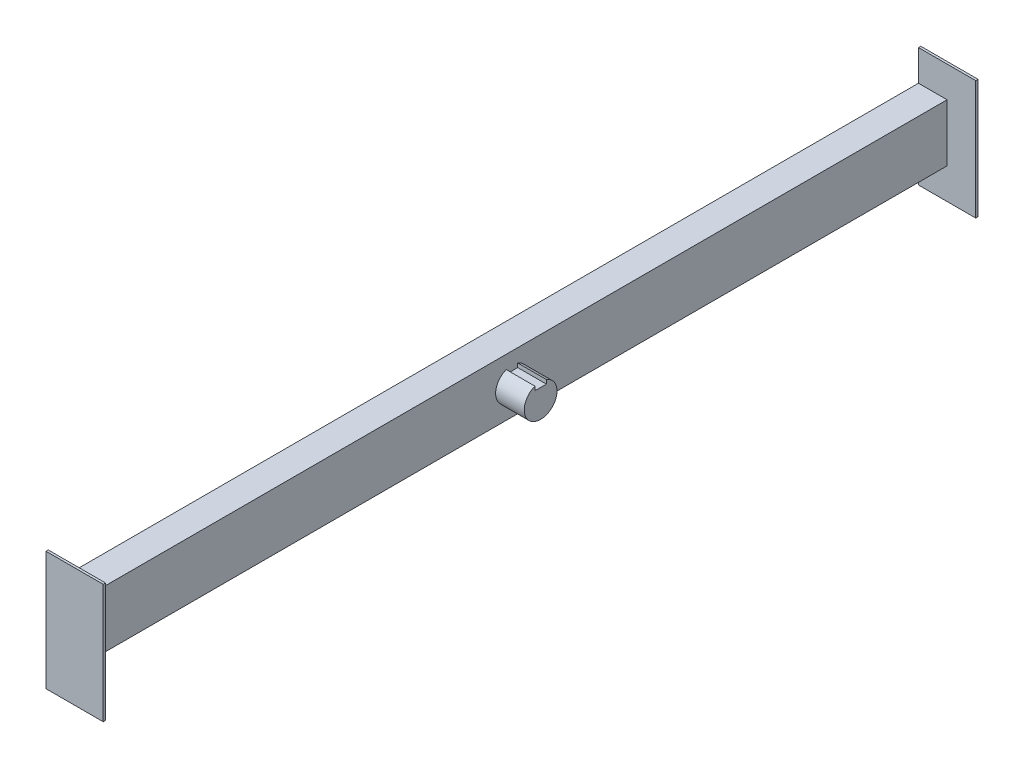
ISO-10303-21;
HEADER;
FILE_DESCRIPTION(('STEP AP214'),'2;1');
FILE_NAME('part.step','',(''),(''),'','','');
FILE_SCHEMA(('AUTOMOTIVE_DESIGN { 1 0 10303 214 1 1 1 1 }'));
ENDSEC;
DATA;
#1=APPLICATION_CONTEXT('core data for automotive mechanical design processes');
#2=APPLICATION_PROTOCOL_DEFINITION('international standard','automotive_design',2000,#1);
#3=PRODUCT_CONTEXT('',#1,'mechanical');
#4=PRODUCT('Part','Part','',(#3));
#5=PRODUCT_RELATED_PRODUCT_CATEGORY('part','',(#4));
#6=PRODUCT_DEFINITION_FORMATION('','',#4);
#7=PRODUCT_DEFINITION_CONTEXT('part definition',#1,'design');
#8=PRODUCT_DEFINITION('design','',#6,#7);
#9=PRODUCT_DEFINITION_SHAPE('','',#8);
#10=(LENGTH_UNIT() NAMED_UNIT(*) SI_UNIT(.MILLI.,.METRE.));
#11=(NAMED_UNIT(*) PLANE_ANGLE_UNIT() SI_UNIT($,.RADIAN.));
#12=(NAMED_UNIT(*) SI_UNIT($,.STERADIAN.) SOLID_ANGLE_UNIT());
#13=UNCERTAINTY_MEASURE_WITH_UNIT(LENGTH_MEASURE(1.E-05),#10,'distance_accuracy_value','');
#14=(GEOMETRIC_REPRESENTATION_CONTEXT(3) GLOBAL_UNCERTAINTY_ASSIGNED_CONTEXT((#13)) GLOBAL_UNIT_ASSIGNED_CONTEXT((#10,
#11,#12)) REPRESENTATION_CONTEXT('',''));
#15=CARTESIAN_POINT('',(0.,0.,0.));
#16=DIRECTION('',(0.,0.,1.));
#17=DIRECTION('',(1.,0.,0.));
#18=AXIS2_PLACEMENT_3D('',#15,#16,#17);
#19=CARTESIAN_POINT('',(25.,0.,760.));
#20=DIRECTION('',(-1.,0.,0.));
#21=DIRECTION('',(0.,-1.,0.));
#22=AXIS2_PLACEMENT_3D('',#19,#20,#21);
#23=PLANE('',#22);
#24=DIRECTION('',(0.,1.,0.));
#25=VECTOR('',#24,1.);
#26=CARTESIAN_POINT('',(25.,0.,0.));
#27=LINE('',#26,#25);
#28=CARTESIAN_POINT('',(25.,0.,0.));
#29=VERTEX_POINT('',#28);
#30=CARTESIAN_POINT('',(25.,50.,0.));
#31=VERTEX_POINT('',#30);
#32=EDGE_CURVE('E273',#29,#31,#27,.T.);
#33=ORIENTED_EDGE('',*,*,#32,.T.);
#34=DIRECTION('',(0.,0.,-1.));
#35=VECTOR('',#34,1.);
#36=CARTESIAN_POINT('',(25.,50.,760.));
#37=LINE('',#36,#35);
#38=CARTESIAN_POINT('',(25.,50.,760.));
#39=VERTEX_POINT('',#38);
#40=EDGE_CURVE('E271',#39,#31,#37,.T.);
#41=ORIENTED_EDGE('',*,*,#40,.F.);
#42=DIRECTION('',(0.,1.,0.));
#43=VECTOR('',#42,1.);
#44=CARTESIAN_POINT('',(25.,0.,760.));
#45=LINE('',#44,#43);
#46=CARTESIAN_POINT('',(25.,0.,760.));
#47=VERTEX_POINT('',#46);
#48=EDGE_CURVE('E275',#47,#39,#45,.T.);
#49=ORIENTED_EDGE('',*,*,#48,.F.);
#50=DIRECTION('',(0.,0.,-1.));
#51=VECTOR('',#50,1.);
#52=CARTESIAN_POINT('',(25.,0.,760.));
#53=LINE('',#52,#51);
#54=EDGE_CURVE('E47',#47,#29,#53,.T.);
#55=ORIENTED_EDGE('',*,*,#54,.T.);
#56=EDGE_LOOP('',(#33,#41,#49,#55));
#57=FACE_BOUND('',#56,.T.);
#58=DIRECTION('',(0.,-1.,0.));
#59=VECTOR('',#58,1.);
#60=CARTESIAN_POINT('',(25.,38.3966790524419,375.));
#61=LINE('',#60,#59);
#62=CARTESIAN_POINT('',(25.,38.3966790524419,375.));
#63=VERTEX_POINT('',#62);
#64=CARTESIAN_POINT('',(25.,34.9098144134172,375.));
#65=VERTEX_POINT('',#64);
#66=EDGE_CURVE('E197',#63,#65,#61,.T.);
#67=ORIENTED_EDGE('',*,*,#66,.F.);
#68=CARTESIAN_POINT('',(25.,25.,380.));
#69=DIRECTION('',(1.,0.,0.));
#70=DIRECTION('',(0.,1.,0.));
#71=AXIS2_PLACEMENT_3D('',#68,#69,#70);
#72=CIRCLE('',#71,14.2993359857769);
#73=CARTESIAN_POINT('',(25.,38.3966790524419,385.));
#74=VERTEX_POINT('',#73);
#75=EDGE_CURVE('E194',#74,#63,#72,.T.);
#76=ORIENTED_EDGE('',*,*,#75,.F.);
#77=DIRECTION('',(0.,1.,0.));
#78=VECTOR('',#77,1.);
#79=CARTESIAN_POINT('',(25.,38.3966790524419,385.));
#80=LINE('',#79,#78);
#81=CARTESIAN_POINT('',(25.,34.9098144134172,385.));
#82=VERTEX_POINT('',#81);
#83=EDGE_CURVE('E60',#82,#74,#80,.T.);
#84=ORIENTED_EDGE('',*,*,#83,.F.);
#85=DIRECTION('',(0.,0.,1.));
#86=VECTOR('',#85,1.);
#87=CARTESIAN_POINT('',(25.,34.9098144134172,385.));
#88=LINE('',#87,#86);
#89=EDGE_CURVE('E55',#65,#82,#88,.T.);
#90=ORIENTED_EDGE('',*,*,#89,.F.);
#91=EDGE_LOOP('',(#67,#76,#84,#90));
#92=FACE_BOUND('',#91,.T.);
#93=ADVANCED_FACE('F36',(#57,#92),#23,.F.);
#94=CARTESIAN_POINT('',(0.,0.,760.));
#95=DIRECTION('',(1.,0.,0.));
#96=DIRECTION('',(0.,0.,-1.));
#97=AXIS2_PLACEMENT_3D('',#94,#95,#96);
#98=PLANE('',#97);
#99=DIRECTION('',(0.,0.,-1.));
#100=VECTOR('',#99,1.);
#101=CARTESIAN_POINT('',(0.,50.,760.));
#102=LINE('',#101,#100);
#103=CARTESIAN_POINT('',(0.,50.,760.));
#104=VERTEX_POINT('',#103);
#105=CARTESIAN_POINT('',(0.,50.,0.));
#106=VERTEX_POINT('',#105);
#107=EDGE_CURVE('E263',#104,#106,#102,.T.);
#108=ORIENTED_EDGE('',*,*,#107,.T.);
#109=DIRECTION('',(0.,1.,0.));
#110=VECTOR('',#109,1.);
#111=CARTESIAN_POINT('',(0.,77.,0.));
#112=LINE('',#111,#110);
#113=CARTESIAN_POINT('',(0.,77.,0.));
#114=VERTEX_POINT('',#113);
#115=EDGE_CURVE('E219',#106,#114,#112,.T.);
#116=ORIENTED_EDGE('',*,*,#115,.T.);
#117=DIRECTION('',(0.,0.,1.));
#118=VECTOR('',#117,1.);
#119=CARTESIAN_POINT('',(0.,77.,-2.));
#120=LINE('',#119,#118);
#121=CARTESIAN_POINT('',(0.,77.,-2.));
#122=VERTEX_POINT('',#121);
#123=EDGE_CURVE('E237',#122,#114,#120,.T.);
#124=ORIENTED_EDGE('',*,*,#123,.F.);
#125=DIRECTION('',(0.,1.,0.));
#126=VECTOR('',#125,1.);
#127=CARTESIAN_POINT('',(0.,77.,-2.));
#128=LINE('',#127,#126);
#129=CARTESIAN_POINT('',(0.,-27.,-2.));
#130=VERTEX_POINT('',#129);
#131=EDGE_CURVE('E213',#130,#122,#128,.T.);
#132=ORIENTED_EDGE('',*,*,#131,.F.);
#133=DIRECTION('',(0.,0.,1.));
#134=VECTOR('',#133,1.);
#135=CARTESIAN_POINT('',(0.,-27.,-2.));
#136=LINE('',#135,#134);
#137=CARTESIAN_POINT('',(0.,-27.,0.));
#138=VERTEX_POINT('',#137);
#139=EDGE_CURVE('E234',#130,#138,#136,.T.);
#140=ORIENTED_EDGE('',*,*,#139,.T.);
#141=CARTESIAN_POINT('',(0.,0.,0.));
#142=VERTEX_POINT('',#141);
#143=EDGE_CURVE('E227',#138,#142,#112,.T.);
#144=ORIENTED_EDGE('',*,*,#143,.T.);
#145=DIRECTION('',(0.,0.,-1.));
#146=VECTOR('',#145,1.);
#147=CARTESIAN_POINT('',(0.,0.,760.));
#148=LINE('',#147,#146);
#149=CARTESIAN_POINT('',(0.,0.,760.));
#150=VERTEX_POINT('',#149);
#151=EDGE_CURVE('E11',#150,#142,#148,.T.);
#152=ORIENTED_EDGE('',*,*,#151,.F.);
#153=DIRECTION('',(0.,-1.,0.));
#154=VECTOR('',#153,1.);
#155=CARTESIAN_POINT('',(0.,77.,760.));
#156=LINE('',#155,#154);
#157=CARTESIAN_POINT('',(0.,-27.,760.));
#158=VERTEX_POINT('',#157);
#159=EDGE_CURVE('E233',#150,#158,#156,.T.);
#160=ORIENTED_EDGE('',*,*,#159,.T.);
#161=DIRECTION('',(0.,0.,-1.));
#162=VECTOR('',#161,1.);
#163=CARTESIAN_POINT('',(0.,-27.,762.));
#164=LINE('',#163,#162);
#165=CARTESIAN_POINT('',(0.,-27.,762.));
#166=VERTEX_POINT('',#165);
#167=EDGE_CURVE('E329',#166,#158,#164,.T.);
#168=ORIENTED_EDGE('',*,*,#167,.F.);
#169=DIRECTION('',(0.,-1.,0.));
#170=VECTOR('',#169,1.);
#171=CARTESIAN_POINT('',(0.,77.,762.));
#172=LINE('',#171,#170);
#173=CARTESIAN_POINT('',(0.,77.,762.));
#174=VERTEX_POINT('',#173);
#175=EDGE_CURVE('E356',#174,#166,#172,.T.);
#176=ORIENTED_EDGE('',*,*,#175,.F.);
#177=DIRECTION('',(0.,0.,-1.));
#178=VECTOR('',#177,1.);
#179=CARTESIAN_POINT('',(0.,77.,762.));
#180=LINE('',#179,#178);
#181=CARTESIAN_POINT('',(0.,77.,760.));
#182=VERTEX_POINT('',#181);
#183=EDGE_CURVE('E357',#174,#182,#180,.T.);
#184=ORIENTED_EDGE('',*,*,#183,.T.);
#185=EDGE_CURVE('E342',#182,#104,#156,.T.);
#186=ORIENTED_EDGE('',*,*,#185,.T.);
#187=EDGE_LOOP('',(#108,#116,#124,#132,#140,#144,#152,#160,#168,#176,#184,#186));
#188=FACE_BOUND('',#187,.T.);
#189=ADVANCED_FACE('F38',(#188),#98,.F.);
#190=CARTESIAN_POINT('',(0.,0.,760.));
#191=DIRECTION('',(0.,1.,0.));
#192=DIRECTION('',(0.,0.,1.));
#193=AXIS2_PLACEMENT_3D('',#190,#191,#192);
#194=PLANE('',#193);
#195=DIRECTION('',(1.,0.,0.));
#196=VECTOR('',#195,1.);
#197=CARTESIAN_POINT('',(0.,0.,0.));
#198=LINE('',#197,#196);
#199=EDGE_CURVE('E277',#142,#29,#198,.T.);
#200=ORIENTED_EDGE('',*,*,#199,.T.);
#201=ORIENTED_EDGE('',*,*,#54,.F.);
#202=DIRECTION('',(1.,0.,0.));
#203=VECTOR('',#202,1.);
#204=CARTESIAN_POINT('',(0.,0.,760.));
#205=LINE('',#204,#203);
#206=EDGE_CURVE('E272',#150,#47,#205,.T.);
#207=ORIENTED_EDGE('',*,*,#206,.F.);
#208=ORIENTED_EDGE('',*,*,#151,.T.);
#209=EDGE_LOOP('',(#200,#201,#207,#208));
#210=FACE_BOUND('',#209,.T.);
#211=ADVANCED_FACE('F405',(#210),#194,.F.);
#212=CARTESIAN_POINT('',(0.,50.,760.));
#213=DIRECTION('',(0.,-1.,0.));
#214=DIRECTION('',(0.,0.,-1.));
#215=AXIS2_PLACEMENT_3D('',#212,#213,#214);
#216=PLANE('',#215);
#217=DIRECTION('',(-1.,0.,0.));
#218=VECTOR('',#217,1.);
#219=CARTESIAN_POINT('',(0.,50.,0.));
#220=LINE('',#219,#218);
#221=EDGE_CURVE('E40',#31,#106,#220,.T.);
#222=ORIENTED_EDGE('',*,*,#221,.T.);
#223=ORIENTED_EDGE('',*,*,#107,.F.);
#224=DIRECTION('',(-1.,0.,0.));
#225=VECTOR('',#224,1.);
#226=CARTESIAN_POINT('',(0.,50.,760.));
#227=LINE('',#226,#225);
#228=EDGE_CURVE('E292',#39,#104,#227,.T.);
#229=ORIENTED_EDGE('',*,*,#228,.F.);
#230=ORIENTED_EDGE('',*,*,#40,.T.);
#231=EDGE_LOOP('',(#222,#223,#229,#230));
#232=FACE_BOUND('',#231,.T.);
#233=ADVANCED_FACE('F268',(#232),#216,.F.);
#234=CARTESIAN_POINT('',(0.,-27.,760.));
#235=DIRECTION('',(0.,0.,1.));
#236=DIRECTION('',(1.,0.,0.));
#237=AXIS2_PLACEMENT_3D('',#234,#235,#236);
#238=PLANE('',#237);
#239=ORIENTED_EDGE('',*,*,#159,.F.);
#240=ORIENTED_EDGE('',*,*,#206,.T.);
#241=ORIENTED_EDGE('',*,*,#48,.T.);
#242=ORIENTED_EDGE('',*,*,#228,.T.);
#243=ORIENTED_EDGE('',*,*,#185,.F.);
#244=DIRECTION('',(-1.,0.,0.));
#245=VECTOR('',#244,1.);
#246=CARTESIAN_POINT('',(0.,77.,760.));
#247=LINE('',#246,#245);
#248=CARTESIAN_POINT('',(50.,77.,760.));
#249=VERTEX_POINT('',#248);
#250=EDGE_CURVE('E354',#249,#182,#247,.T.);
#251=ORIENTED_EDGE('',*,*,#250,.F.);
#252=DIRECTION('',(0.,1.,0.));
#253=VECTOR('',#252,1.);
#254=CARTESIAN_POINT('',(50.,77.,760.));
#255=LINE('',#254,#253);
#256=CARTESIAN_POINT('',(50.,-27.,760.));
#257=VERTEX_POINT('',#256);
#258=EDGE_CURVE('E352',#257,#249,#255,.T.);
#259=ORIENTED_EDGE('',*,*,#258,.F.);
#260=DIRECTION('',(1.,0.,0.));
#261=VECTOR('',#260,1.);
#262=CARTESIAN_POINT('',(0.,-27.,760.));
#263=LINE('',#262,#261);
#264=EDGE_CURVE('E349',#158,#257,#263,.T.);
#265=ORIENTED_EDGE('',*,*,#264,.F.);
#266=EDGE_LOOP('',(#239,#240,#241,#242,#243,#251,#259,#265));
#267=FACE_BOUND('',#266,.T.);
#268=ADVANCED_FACE('F377',(#267),#238,.F.);
#269=CARTESIAN_POINT('',(0.,-27.,762.));
#270=DIRECTION('',(0.,1.,0.));
#271=DIRECTION('',(0.,0.,1.));
#272=AXIS2_PLACEMENT_3D('',#269,#270,#271);
#273=PLANE('',#272);
#274=ORIENTED_EDGE('',*,*,#264,.T.);
#275=DIRECTION('',(0.,0.,-1.));
#276=VECTOR('',#275,1.);
#277=CARTESIAN_POINT('',(50.,-27.,762.));
#278=LINE('',#277,#276);
#279=CARTESIAN_POINT('',(50.,-27.,762.));
#280=VERTEX_POINT('',#279);
#281=EDGE_CURVE('E363',#280,#257,#278,.T.);
#282=ORIENTED_EDGE('',*,*,#281,.F.);
#283=DIRECTION('',(1.,0.,0.));
#284=VECTOR('',#283,1.);
#285=CARTESIAN_POINT('',(0.,-27.,762.));
#286=LINE('',#285,#284);
#287=EDGE_CURVE('E371',#166,#280,#286,.T.);
#288=ORIENTED_EDGE('',*,*,#287,.F.);
#289=ORIENTED_EDGE('',*,*,#167,.T.);
#290=EDGE_LOOP('',(#274,#282,#288,#289));
#291=FACE_BOUND('',#290,.T.);
#292=ADVANCED_FACE('F368',(#291),#273,.F.);
#293=CARTESIAN_POINT('',(50.,77.,762.));
#294=DIRECTION('',(-1.,0.,0.));
#295=DIRECTION('',(0.,-1.,0.));
#296=AXIS2_PLACEMENT_3D('',#293,#294,#295);
#297=PLANE('',#296);
#298=ORIENTED_EDGE('',*,*,#258,.T.);
#299=DIRECTION('',(0.,0.,-1.));
#300=VECTOR('',#299,1.);
#301=CARTESIAN_POINT('',(50.,77.,762.));
#302=LINE('',#301,#300);
#303=CARTESIAN_POINT('',(50.,77.,762.));
#304=VERTEX_POINT('',#303);
#305=EDGE_CURVE('E360',#304,#249,#302,.T.);
#306=ORIENTED_EDGE('',*,*,#305,.F.);
#307=DIRECTION('',(0.,1.,0.));
#308=VECTOR('',#307,1.);
#309=CARTESIAN_POINT('',(50.,77.,762.));
#310=LINE('',#309,#308);
#311=EDGE_CURVE('E388',#280,#304,#310,.T.);
#312=ORIENTED_EDGE('',*,*,#311,.F.);
#313=ORIENTED_EDGE('',*,*,#281,.T.);
#314=EDGE_LOOP('',(#298,#306,#312,#313));
#315=FACE_BOUND('',#314,.T.);
#316=ADVANCED_FACE('F381',(#315),#297,.F.);
#317=CARTESIAN_POINT('',(0.,77.,762.));
#318=DIRECTION('',(0.,-1.,0.));
#319=DIRECTION('',(0.,0.,-1.));
#320=AXIS2_PLACEMENT_3D('',#317,#318,#319);
#321=PLANE('',#320);
#322=ORIENTED_EDGE('',*,*,#250,.T.);
#323=ORIENTED_EDGE('',*,*,#183,.F.);
#324=DIRECTION('',(-1.,0.,0.));
#325=VECTOR('',#324,1.);
#326=CARTESIAN_POINT('',(0.,77.,762.));
#327=LINE('',#326,#325);
#328=EDGE_CURVE('E347',#304,#174,#327,.T.);
#329=ORIENTED_EDGE('',*,*,#328,.F.);
#330=ORIENTED_EDGE('',*,*,#305,.T.);
#331=EDGE_LOOP('',(#322,#323,#329,#330));
#332=FACE_BOUND('',#331,.T.);
#333=ADVANCED_FACE('F385',(#332),#321,.F.);
#334=CARTESIAN_POINT('',(0.,-27.,762.));
#335=DIRECTION('',(0.,0.,1.));
#336=DIRECTION('',(1.,0.,0.));
#337=AXIS2_PLACEMENT_3D('',#334,#335,#336);
#338=PLANE('',#337);
#339=ORIENTED_EDGE('',*,*,#175,.T.);
#340=ORIENTED_EDGE('',*,*,#287,.T.);
#341=ORIENTED_EDGE('',*,*,#311,.T.);
#342=ORIENTED_EDGE('',*,*,#328,.T.);
#343=EDGE_LOOP('',(#339,#340,#341,#342));
#344=FACE_BOUND('',#343,.T.);
#345=ADVANCED_FACE('F390',(#344),#338,.T.);
#346=CARTESIAN_POINT('',(50.,77.,-2.));
#347=DIRECTION('',(-1.,0.,0.));
#348=DIRECTION('',(0.,0.,1.));
#349=AXIS2_PLACEMENT_3D('',#346,#347,#348);
#350=PLANE('',#349);
#351=DIRECTION('',(0.,-1.,0.));
#352=VECTOR('',#351,1.);
#353=CARTESIAN_POINT('',(50.,77.,0.));
#354=LINE('',#353,#352);
#355=CARTESIAN_POINT('',(50.,77.,0.));
#356=VERTEX_POINT('',#355);
#357=CARTESIAN_POINT('',(50.,-27.,0.));
#358=VERTEX_POINT('',#357);
#359=EDGE_CURVE('E198',#356,#358,#354,.T.);
#360=ORIENTED_EDGE('',*,*,#359,.T.);
#361=DIRECTION('',(0.,0.,1.));
#362=VECTOR('',#361,1.);
#363=CARTESIAN_POINT('',(50.,-27.,-2.));
#364=LINE('',#363,#362);
#365=CARTESIAN_POINT('',(50.,-27.,-2.));
#366=VERTEX_POINT('',#365);
#367=EDGE_CURVE('E230',#366,#358,#364,.T.);
#368=ORIENTED_EDGE('',*,*,#367,.F.);
#369=DIRECTION('',(0.,-1.,0.));
#370=VECTOR('',#369,1.);
#371=CARTESIAN_POINT('',(50.,77.,-2.));
#372=LINE('',#371,#370);
#373=CARTESIAN_POINT('',(50.,77.,-2.));
#374=VERTEX_POINT('',#373);
#375=EDGE_CURVE('E207',#374,#366,#372,.T.);
#376=ORIENTED_EDGE('',*,*,#375,.F.);
#377=DIRECTION('',(0.,0.,1.));
#378=VECTOR('',#377,1.);
#379=CARTESIAN_POINT('',(50.,77.,-2.));
#380=LINE('',#379,#378);
#381=EDGE_CURVE('E216',#374,#356,#380,.T.);
#382=ORIENTED_EDGE('',*,*,#381,.T.);
#383=EDGE_LOOP('',(#360,#368,#376,#382));
#384=FACE_BOUND('',#383,.T.);
#385=ADVANCED_FACE('F244',(#384),#350,.F.);
#386=CARTESIAN_POINT('',(50.,-27.,-2.));
#387=DIRECTION('',(0.,1.,0.));
#388=DIRECTION('',(0.,0.,1.));
#389=AXIS2_PLACEMENT_3D('',#386,#387,#388);
#390=PLANE('',#389);
#391=DIRECTION('',(-1.,0.,0.));
#392=VECTOR('',#391,1.);
#393=CARTESIAN_POINT('',(50.,-27.,0.));
#394=LINE('',#393,#392);
#395=EDGE_CURVE('E201',#358,#138,#394,.T.);
#396=ORIENTED_EDGE('',*,*,#395,.T.);
#397=ORIENTED_EDGE('',*,*,#139,.F.);
#398=DIRECTION('',(-1.,0.,0.));
#399=VECTOR('',#398,1.);
#400=CARTESIAN_POINT('',(50.,-27.,-2.));
#401=LINE('',#400,#399);
#402=EDGE_CURVE('E210',#366,#130,#401,.T.);
#403=ORIENTED_EDGE('',*,*,#402,.F.);
#404=ORIENTED_EDGE('',*,*,#367,.T.);
#405=EDGE_LOOP('',(#396,#397,#403,#404));
#406=FACE_BOUND('',#405,.T.);
#407=ADVANCED_FACE('F254',(#406),#390,.F.);
#408=CARTESIAN_POINT('',(50.,77.,-2.));
#409=DIRECTION('',(0.,-1.,0.));
#410=DIRECTION('',(0.,0.,-1.));
#411=AXIS2_PLACEMENT_3D('',#408,#409,#410);
#412=PLANE('',#411);
#413=DIRECTION('',(1.,0.,0.));
#414=VECTOR('',#413,1.);
#415=CARTESIAN_POINT('',(50.,77.,0.));
#416=LINE('',#415,#414);
#417=EDGE_CURVE('E211',#114,#356,#416,.T.);
#418=ORIENTED_EDGE('',*,*,#417,.T.);
#419=ORIENTED_EDGE('',*,*,#381,.F.);
#420=DIRECTION('',(1.,0.,0.));
#421=VECTOR('',#420,1.);
#422=CARTESIAN_POINT('',(50.,77.,-2.));
#423=LINE('',#422,#421);
#424=EDGE_CURVE('E215',#122,#374,#423,.T.);
#425=ORIENTED_EDGE('',*,*,#424,.F.);
#426=ORIENTED_EDGE('',*,*,#123,.T.);
#427=EDGE_LOOP('',(#418,#419,#425,#426));
#428=FACE_BOUND('',#427,.T.);
#429=ADVANCED_FACE('F259',(#428),#412,.F.);
#430=CARTESIAN_POINT('',(50.,-27.,-2.));
#431=DIRECTION('',(0.,0.,-1.));
#432=DIRECTION('',(-1.,0.,0.));
#433=AXIS2_PLACEMENT_3D('',#430,#431,#432);
#434=PLANE('',#433);
#435=ORIENTED_EDGE('',*,*,#375,.T.);
#436=ORIENTED_EDGE('',*,*,#402,.T.);
#437=ORIENTED_EDGE('',*,*,#131,.T.);
#438=ORIENTED_EDGE('',*,*,#424,.T.);
#439=EDGE_LOOP('',(#435,#436,#437,#438));
#440=FACE_BOUND('',#439,.T.);
#441=ADVANCED_FACE('F257',(#440),#434,.T.);
#442=CARTESIAN_POINT('',(50.,-27.,0.));
#443=DIRECTION('',(0.,0.,-1.));
#444=DIRECTION('',(-1.,0.,0.));
#445=AXIS2_PLACEMENT_3D('',#442,#443,#444);
#446=PLANE('',#445);
#447=ORIENTED_EDGE('',*,*,#221,.F.);
#448=ORIENTED_EDGE('',*,*,#32,.F.);
#449=ORIENTED_EDGE('',*,*,#199,.F.);
#450=ORIENTED_EDGE('',*,*,#143,.F.);
#451=ORIENTED_EDGE('',*,*,#395,.F.);
#452=ORIENTED_EDGE('',*,*,#359,.F.);
#453=ORIENTED_EDGE('',*,*,#417,.F.);
#454=ORIENTED_EDGE('',*,*,#115,.F.);
#455=EDGE_LOOP('',(#447,#448,#449,#450,#451,#452,#453,#454));
#456=FACE_BOUND('',#455,.T.);
#457=ADVANCED_FACE('F250',(#456),#446,.F.);
#458=CARTESIAN_POINT('',(50.,38.3966790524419,375.));
#459=DIRECTION('',(0.,0.,-1.));
#460=DIRECTION('',(-1.,0.,0.));
#461=AXIS2_PLACEMENT_3D('',#458,#459,#460);
#462=PLANE('',#461);
#463=ORIENTED_EDGE('',*,*,#66,.T.);
#464=DIRECTION('',(-1.,0.,0.));
#465=VECTOR('',#464,1.);
#466=CARTESIAN_POINT('',(50.,34.9098144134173,375.));
#467=LINE('',#466,#465);
#468=CARTESIAN_POINT('',(50.,34.9098144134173,375.));
#469=VERTEX_POINT('',#468);
#470=EDGE_CURVE('E178',#469,#65,#467,.T.);
#471=ORIENTED_EDGE('',*,*,#470,.F.);
#472=DIRECTION('',(0.,-1.,0.));
#473=VECTOR('',#472,1.);
#474=CARTESIAN_POINT('',(50.,38.3966790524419,375.));
#475=LINE('',#474,#473);
#476=CARTESIAN_POINT('',(50.,38.3966790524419,375.));
#477=VERTEX_POINT('',#476);
#478=EDGE_CURVE('E185',#477,#469,#475,.T.);
#479=ORIENTED_EDGE('',*,*,#478,.F.);
#480=DIRECTION('',(-1.,0.,0.));
#481=VECTOR('',#480,1.);
#482=CARTESIAN_POINT('',(50.,38.3966790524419,375.));
#483=LINE('',#482,#481);
#484=EDGE_CURVE('E601',#477,#63,#483,.T.);
#485=ORIENTED_EDGE('',*,*,#484,.T.);
#486=EDGE_LOOP('',(#463,#471,#479,#485));
#487=FACE_BOUND('',#486,.T.);
#488=ADVANCED_FACE('F196',(#487),#462,.F.);
#489=CARTESIAN_POINT('',(50.,34.9098144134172,385.));
#490=DIRECTION('',(0.,-1.,0.));
#491=DIRECTION('',(0.,0.,-1.));
#492=AXIS2_PLACEMENT_3D('',#489,#490,#491);
#493=PLANE('',#492);
#494=ORIENTED_EDGE('',*,*,#89,.T.);
#495=DIRECTION('',(-1.,0.,0.));
#496=VECTOR('',#495,1.);
#497=CARTESIAN_POINT('',(50.,34.9098144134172,385.));
#498=LINE('',#497,#496);
#499=CARTESIAN_POINT('',(50.,34.9098144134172,385.));
#500=VERTEX_POINT('',#499);
#501=EDGE_CURVE('E181',#500,#82,#498,.T.);
#502=ORIENTED_EDGE('',*,*,#501,.F.);
#503=DIRECTION('',(0.,0.,1.));
#504=VECTOR('',#503,1.);
#505=CARTESIAN_POINT('',(50.,34.9098144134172,385.));
#506=LINE('',#505,#504);
#507=EDGE_CURVE('E174',#469,#500,#506,.T.);
#508=ORIENTED_EDGE('',*,*,#507,.F.);
#509=ORIENTED_EDGE('',*,*,#470,.T.);
#510=EDGE_LOOP('',(#494,#502,#508,#509));
#511=FACE_BOUND('',#510,.T.);
#512=ADVANCED_FACE('F176',(#511),#493,.F.);
#513=CARTESIAN_POINT('',(50.,38.3966790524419,385.));
#514=DIRECTION('',(0.,0.,1.));
#515=DIRECTION('',(1.,0.,0.));
#516=AXIS2_PLACEMENT_3D('',#513,#514,#515);
#517=PLANE('',#516);
#518=ORIENTED_EDGE('',*,*,#83,.T.);
#519=DIRECTION('',(-1.,0.,0.));
#520=VECTOR('',#519,1.);
#521=CARTESIAN_POINT('',(50.,38.3966790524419,385.));
#522=LINE('',#521,#520);
#523=CARTESIAN_POINT('',(50.,38.3966790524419,385.));
#524=VERTEX_POINT('',#523);
#525=EDGE_CURVE('E203',#524,#74,#522,.T.);
#526=ORIENTED_EDGE('',*,*,#525,.F.);
#527=DIRECTION('',(0.,1.,0.));
#528=VECTOR('',#527,1.);
#529=CARTESIAN_POINT('',(50.,38.3966790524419,385.));
#530=LINE('',#529,#528);
#531=EDGE_CURVE('E184',#500,#524,#530,.T.);
#532=ORIENTED_EDGE('',*,*,#531,.F.);
#533=ORIENTED_EDGE('',*,*,#501,.T.);
#534=EDGE_LOOP('',(#518,#526,#532,#533));
#535=FACE_BOUND('',#534,.T.);
#536=ADVANCED_FACE('F569',(#535),#517,.F.);
#537=CARTESIAN_POINT('',(50.,25.,380.));
#538=DIRECTION('',(-1.,0.,0.));
#539=DIRECTION('',(0.,-1.,0.));
#540=AXIS2_PLACEMENT_3D('',#537,#538,#539);
#541=CYLINDRICAL_SURFACE('',#540,14.2993359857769);
#542=ORIENTED_EDGE('',*,*,#75,.T.);
#543=ORIENTED_EDGE('',*,*,#484,.F.);
#544=CARTESIAN_POINT('',(50.,25.,380.));
#545=DIRECTION('',(1.,0.,0.));
#546=DIRECTION('',(0.,1.,0.));
#547=AXIS2_PLACEMENT_3D('',#544,#545,#546);
#548=CIRCLE('',#547,14.2993359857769);
#549=EDGE_CURVE('E190',#524,#477,#548,.T.);
#550=ORIENTED_EDGE('',*,*,#549,.F.);
#551=ORIENTED_EDGE('',*,*,#525,.T.);
#552=EDGE_LOOP('',(#542,#543,#550,#551));
#553=FACE_BOUND('',#552,.T.);
#554=ADVANCED_FACE('F578',(#553),#541,.T.);
#555=CARTESIAN_POINT('',(50.,25.,380.));
#556=DIRECTION('',(1.,0.,0.));
#557=DIRECTION('',(0.,1.,0.));
#558=AXIS2_PLACEMENT_3D('',#555,#556,#557);
#559=PLANE('',#558);
#560=ORIENTED_EDGE('',*,*,#478,.T.);
#561=ORIENTED_EDGE('',*,*,#507,.T.);
#562=ORIENTED_EDGE('',*,*,#531,.T.);
#563=ORIENTED_EDGE('',*,*,#549,.T.);
#564=EDGE_LOOP('',(#560,#561,#562,#563));
#565=FACE_BOUND('',#564,.T.);
#566=ADVANCED_FACE('F188',(#565),#559,.T.);
#567=CLOSED_SHELL('',(#93,#189,#211,#233,#268,#292,#316,#333,#345,#385,#407,#429,#441,#457,#488,
#512,#536,#554,#566));
#568=DIRECTION('',(-1.,0.,0.));
#569=VECTOR('',#568,1.);
#570=CARTESIAN_POINT('',(2.,48.,0.));
#571=LINE('',#570,#569);
#572=CARTESIAN_POINT('',(23.,48.,0.));
#573=VERTEX_POINT('',#572);
#574=CARTESIAN_POINT('',(2.,48.,0.));
#575=VERTEX_POINT('',#574);
#576=EDGE_CURVE('E320',#573,#575,#571,.T.);
#577=ORIENTED_EDGE('',*,*,#576,.T.);
#578=DIRECTION('',(0.,-1.,0.));
#579=VECTOR('',#578,1.);
#580=CARTESIAN_POINT('',(2.,2.,0.));
#581=LINE('',#580,#579);
#582=CARTESIAN_POINT('',(2.,2.,0.));
#583=VERTEX_POINT('',#582);
#584=EDGE_CURVE('E316',#575,#583,#581,.T.);
#585=ORIENTED_EDGE('',*,*,#584,.T.);
#586=DIRECTION('',(1.,0.,0.));
#587=VECTOR('',#586,1.);
#588=CARTESIAN_POINT('',(2.,2.,0.));
#589=LINE('',#588,#587);
#590=CARTESIAN_POINT('',(23.,2.,0.));
#591=VERTEX_POINT('',#590);
#592=EDGE_CURVE('E326',#583,#591,#589,.T.);
#593=ORIENTED_EDGE('',*,*,#592,.T.);
#594=DIRECTION('',(0.,1.,0.));
#595=VECTOR('',#594,1.);
#596=CARTESIAN_POINT('',(23.,2.,0.));
#597=LINE('',#596,#595);
#598=EDGE_CURVE('E323',#591,#573,#597,.T.);
#599=ORIENTED_EDGE('',*,*,#598,.T.);
#600=EDGE_LOOP('',(#577,#585,#593,#599));
#601=FACE_BOUND('',#600,.T.);
#602=ADVANCED_FACE('F423',(#601),#446,.F.);
#603=DIRECTION('',(1.,0.,0.));
#604=VECTOR('',#603,1.);
#605=CARTESIAN_POINT('',(2.,2.,760.));
#606=LINE('',#605,#604);
#607=CARTESIAN_POINT('',(2.,2.,760.));
#608=VERTEX_POINT('',#607);
#609=CARTESIAN_POINT('',(23.,2.,760.));
#610=VERTEX_POINT('',#609);
#611=EDGE_CURVE('E319',#608,#610,#606,.T.);
#612=ORIENTED_EDGE('',*,*,#611,.F.);
#613=DIRECTION('',(0.,-1.,0.));
#614=VECTOR('',#613,1.);
#615=CARTESIAN_POINT('',(2.,2.,760.));
#616=LINE('',#615,#614);
#617=CARTESIAN_POINT('',(2.,48.,760.));
#618=VERTEX_POINT('',#617);
#619=EDGE_CURVE('E315',#618,#608,#616,.T.);
#620=ORIENTED_EDGE('',*,*,#619,.F.);
#621=DIRECTION('',(-1.,0.,0.));
#622=VECTOR('',#621,1.);
#623=CARTESIAN_POINT('',(2.,48.,760.));
#624=LINE('',#623,#622);
#625=CARTESIAN_POINT('',(23.,48.,760.));
#626=VERTEX_POINT('',#625);
#627=EDGE_CURVE('E332',#626,#618,#624,.T.);
#628=ORIENTED_EDGE('',*,*,#627,.F.);
#629=DIRECTION('',(0.,1.,0.));
#630=VECTOR('',#629,1.);
#631=CARTESIAN_POINT('',(23.,2.,760.));
#632=LINE('',#631,#630);
#633=EDGE_CURVE('E335',#610,#626,#632,.T.);
#634=ORIENTED_EDGE('',*,*,#633,.F.);
#635=EDGE_LOOP('',(#612,#620,#628,#634));
#636=FACE_BOUND('',#635,.T.);
#637=ADVANCED_FACE('F416',(#636),#238,.F.);
#638=CARTESIAN_POINT('',(2.,48.,760.));
#639=DIRECTION('',(0.,-1.,0.));
#640=DIRECTION('',(0.,0.,-1.));
#641=AXIS2_PLACEMENT_3D('',#638,#639,#640);
#642=PLANE('',#641);
#643=ORIENTED_EDGE('',*,*,#576,.F.);
#644=DIRECTION('',(0.,0.,-1.));
#645=VECTOR('',#644,1.);
#646=CARTESIAN_POINT('',(23.,48.,760.));
#647=LINE('',#646,#645);
#648=EDGE_CURVE('E307',#626,#573,#647,.T.);
#649=ORIENTED_EDGE('',*,*,#648,.F.);
#650=ORIENTED_EDGE('',*,*,#627,.T.);
#651=DIRECTION('',(0.,0.,-1.));
#652=VECTOR('',#651,1.);
#653=CARTESIAN_POINT('',(2.,48.,760.));
#654=LINE('',#653,#652);
#655=EDGE_CURVE('E309',#618,#575,#654,.T.);
#656=ORIENTED_EDGE('',*,*,#655,.T.);
#657=EDGE_LOOP('',(#643,#649,#650,#656));
#658=FACE_BOUND('',#657,.T.);
#659=ADVANCED_FACE('F422',(#658),#642,.T.);
#660=CARTESIAN_POINT('',(23.,2.,760.));
#661=DIRECTION('',(-1.,0.,0.));
#662=DIRECTION('',(0.,0.,1.));
#663=AXIS2_PLACEMENT_3D('',#660,#661,#662);
#664=PLANE('',#663);
#665=ORIENTED_EDGE('',*,*,#598,.F.);
#666=DIRECTION('',(0.,0.,-1.));
#667=VECTOR('',#666,1.);
#668=CARTESIAN_POINT('',(23.,2.,760.));
#669=LINE('',#668,#667);
#670=EDGE_CURVE('E282',#610,#591,#669,.T.);
#671=ORIENTED_EDGE('',*,*,#670,.F.);
#672=ORIENTED_EDGE('',*,*,#633,.T.);
#673=ORIENTED_EDGE('',*,*,#648,.T.);
#674=EDGE_LOOP('',(#665,#671,#672,#673));
#675=FACE_BOUND('',#674,.T.);
#676=ADVANCED_FACE('F430',(#675),#664,.T.);
#677=CARTESIAN_POINT('',(2.,2.,760.));
#678=DIRECTION('',(0.,1.,0.));
#679=DIRECTION('',(0.,0.,1.));
#680=AXIS2_PLACEMENT_3D('',#677,#678,#679);
#681=PLANE('',#680);
#682=ORIENTED_EDGE('',*,*,#592,.F.);
#683=DIRECTION('',(0.,0.,-1.));
#684=VECTOR('',#683,1.);
#685=CARTESIAN_POINT('',(2.,2.,760.));
#686=LINE('',#685,#684);
#687=EDGE_CURVE('E312',#608,#583,#686,.T.);
#688=ORIENTED_EDGE('',*,*,#687,.F.);
#689=ORIENTED_EDGE('',*,*,#611,.T.);
#690=ORIENTED_EDGE('',*,*,#670,.T.);
#691=EDGE_LOOP('',(#682,#688,#689,#690));
#692=FACE_BOUND('',#691,.T.);
#693=ADVANCED_FACE('F441',(#692),#681,.T.);
#694=CARTESIAN_POINT('',(2.,2.,760.));
#695=DIRECTION('',(1.,0.,0.));
#696=DIRECTION('',(0.,0.,-1.));
#697=AXIS2_PLACEMENT_3D('',#694,#695,#696);
#698=PLANE('',#697);
#699=ORIENTED_EDGE('',*,*,#584,.F.);
#700=ORIENTED_EDGE('',*,*,#655,.F.);
#701=ORIENTED_EDGE('',*,*,#619,.T.);
#702=ORIENTED_EDGE('',*,*,#687,.T.);
#703=EDGE_LOOP('',(#699,#700,#701,#702));
#704=FACE_BOUND('',#703,.T.);
#705=ADVANCED_FACE('F440',(#704),#698,.T.);
#706=CLOSED_SHELL('',(#602,#637,#659,#676,#693,#705));
#707=ORIENTED_CLOSED_SHELL('',*,#706,.T.);
#708=BREP_WITH_VOIDS('B2',#567,(#707));
#709=ADVANCED_BREP_SHAPE_REPRESENTATION('',(#18,#708),#14);
#710=SHAPE_DEFINITION_REPRESENTATION(#9,#709);
ENDSEC;
END-ISO-10303-21;
